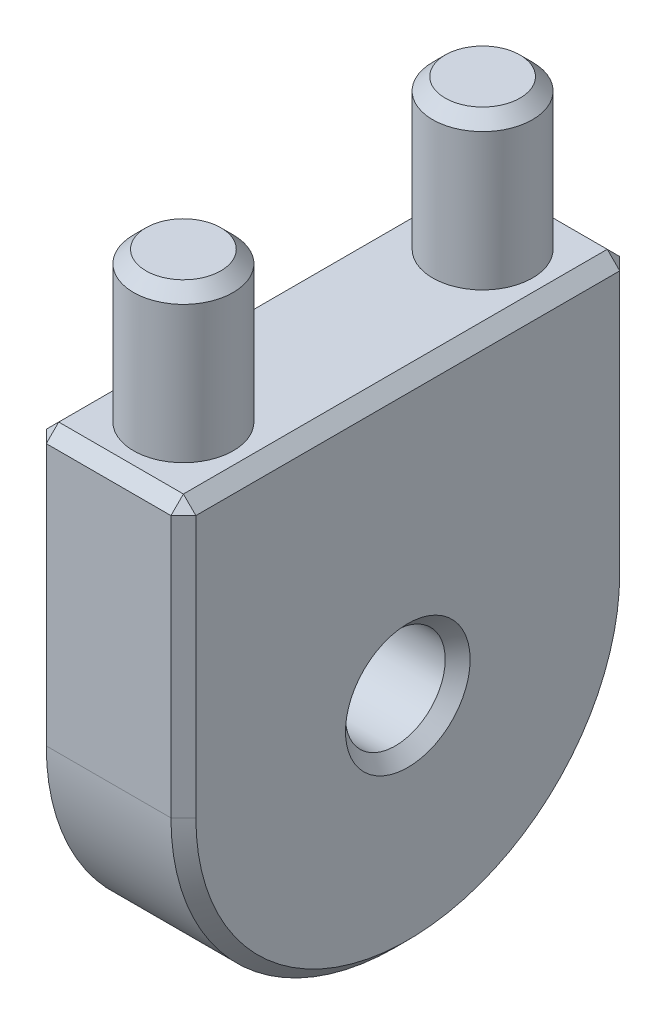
from build123d import *

# Parameters (mm, degrees)
SKETCH_1_R      = 2
EXTRUDE_1_DEPTH = 3
SKETCH_3_R      = 2
EXTRUDE_2_DEPTH = 6
CHAMFER_1_SIZE  = 0.5


with BuildPart() as part:
    # Sketch 1 → Extrude 1 (new, symmetric)
    with BuildSketch(Plane(origin=(0, 0, 0), x_dir=(0, 0, -1), z_dir=(1, 0, 0))):
        with BuildLine():
            Line((-9, 0), (-9, 11))
            Line((-9, 11), (9, 11))
            Line((9, 11), (9, 0))
            ThreePointArc((9, 0), (0, -9), (-9, 0))
        make_face()
        Circle(SKETCH_1_R, mode=Mode.SUBTRACT)
    extrude(amount=EXTRUDE_1_DEPTH, both=True)

    # Sketch 3 → Extrude 2 (add)
    with BuildSketch(Plane(origin=(0, 11, 0), x_dir=(1, 0, 0), z_dir=(0, 1, 0))):
        with Locations(Location((0, 6, 0), (0, 0, 90))):
            Circle(SKETCH_3_R)
        with Locations(Location((0, -6, 0), (0, 0, 90))):
            Circle(SKETCH_3_R)
    extrude(amount=EXTRUDE_2_DEPTH)

    # Chamfer 1
    chamfer_1_edges = [part.edges().sort_by_distance(p)[0] for p in [
        (3, 11, 0),
        (-3, 0, 2),
        (3, 0, 2),
        (3, 5.5, 9),
        (0, 17, -4),
        (0, 17, 8),
        (3, -9, 0),
        (-3, 5.5, 9),
        (-3, 11, 0),
        (-3, 5.5, -9),
        (-3, -9, 0),
        (3, 5.5, -9),
        (0, 11, 9),
        (0, 11, -9),
    ]]
    chamfer(chamfer_1_edges, length=CHAMFER_1_SIZE)


solid = part.part
